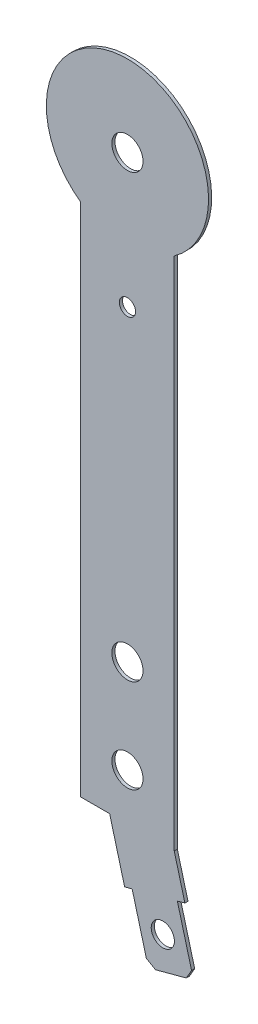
from build123d import *

# Parameters (mm, degrees)
BOSS_EXTRUDE1_DEPTH = 0.3175
SKETCH2_R           = 1.5875
CUT_EXTRUDE1_DEPTH  = 68.952697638
SKETCH3_R           = 1.5875
CUT_EXTRUDE2_DEPTH  = 68.952697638
SKETCH4_R           = 0.8255
CUT_EXTRUDE3_DEPTH  = 68.952697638
BOSS_EXTRUDE2_DEPTH = 0.3175
CHAMFER1_SIZE       = 0.762
SKETCH6_R           = 1.1811
CUT_EXTRUDE4_DEPTH  = 68.952697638


with BuildPart() as part:
    # Sketch1 → Boss-Extrude1 (new body)
    with BuildSketch(Plane.XY):
        with BuildLine():
            Line((-4.7625, 52.451), (-4.7625, 0))
            Line((-4.7625, 0), (4.7625, 0))
            Line((4.7625, 0), (4.7625, 52.451))
            ThreePointArc((4.7625, 52.451), (0, 67.448671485), (-4.7625, 52.451))
        make_face()
    extrude(amount=BOSS_EXTRUDE1_DEPTH)

    # Sketch2 → Cut-Extrude1 (cut, through all)
    with BuildSketch(Plane.XY.offset(0.3175)):
        with Locations((0, 59.193671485)):
            Circle(SKETCH2_R)
    extrude(amount=-CUT_EXTRUDE1_DEPTH, mode=Mode.SUBTRACT)

    # Sketch3 → Cut-Extrude2 (cut, through all)
    with BuildSketch(Plane.XY.offset(0.3175)):
        with Locations((0, 4.7625)):
            Circle(SKETCH3_R)
        with Locations((0, 14.2875)):
            Circle(SKETCH3_R)
    extrude(amount=-CUT_EXTRUDE2_DEPTH, mode=Mode.SUBTRACT)

    # Sketch4 → Cut-Extrude3 (cut, through all)
    with BuildSketch(Plane.XY.offset(0.3175)):
        with Locations((0, 45.5676)):
            Circle(SKETCH4_R)
    extrude(amount=-CUT_EXTRUDE3_DEPTH, mode=Mode.SUBTRACT)

    # Sketch5 → Boss-Extrude2 (add)
    with BuildSketch(Plane.XY.offset(0.3175)):
        Polygon((4.7625, 0), (5.847210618, -4.048195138), (5.080506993, -4.253632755), (6.72400793, -10.387261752), (2.123786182, -11.619887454), (0.480285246, -5.486258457), (-0.286418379, -5.691696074), (-1.811503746, 0), align=None)
    extrude(amount=-BOSS_EXTRUDE2_DEPTH)

    # Chamfer1
    chamfer1_edges = [part.edges().sort_by_distance(p)[0] for p in [
        (6.72400793, -10.387261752, 0.15875),
        (2.123786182, -11.619887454, 0.15875),
    ]]
    chamfer(chamfer1_edges, length=CHAMFER1_SIZE)

    # Sketch6 → Cut-Extrude4 (cut, through all)
    with BuildSketch(Plane.XY.offset(0.3175)):
        with Locations((3.602146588, -7.936760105)):
            Circle(SKETCH6_R)
    extrude(amount=-CUT_EXTRUDE4_DEPTH, mode=Mode.SUBTRACT)


solid = part.part
